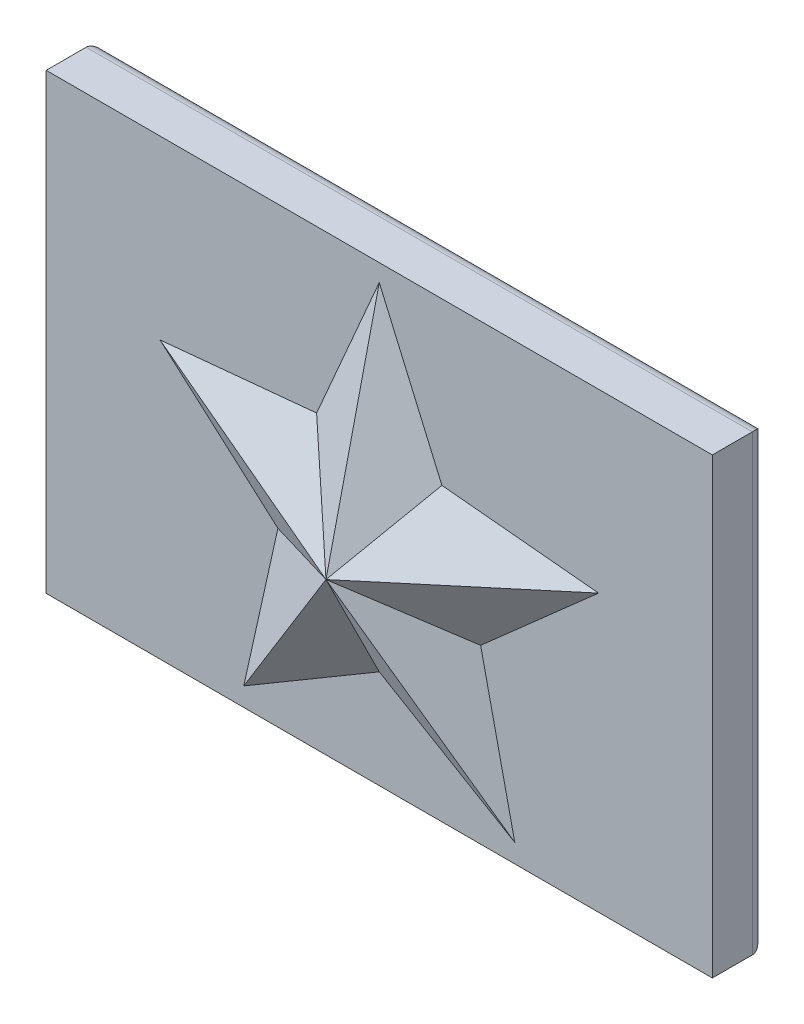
ISO-10303-21;
HEADER;
FILE_DESCRIPTION(('STEP AP214'),'2;1');
FILE_NAME('part.step','',(''),(''),'','','');
FILE_SCHEMA(('AUTOMOTIVE_DESIGN { 1 0 10303 214 1 1 1 1 }'));
ENDSEC;
DATA;
#1=APPLICATION_CONTEXT('core data for automotive mechanical design processes');
#2=APPLICATION_PROTOCOL_DEFINITION('international standard','automotive_design',2000,#1);
#3=PRODUCT_CONTEXT('',#1,'mechanical');
#4=PRODUCT('Part','Part','',(#3));
#5=PRODUCT_RELATED_PRODUCT_CATEGORY('part','',(#4));
#6=PRODUCT_DEFINITION_FORMATION('','',#4);
#7=PRODUCT_DEFINITION_CONTEXT('part definition',#1,'design');
#8=PRODUCT_DEFINITION('design','',#6,#7);
#9=PRODUCT_DEFINITION_SHAPE('','',#8);
#10=(LENGTH_UNIT() NAMED_UNIT(*) SI_UNIT(.MILLI.,.METRE.));
#11=(NAMED_UNIT(*) PLANE_ANGLE_UNIT() SI_UNIT($,.RADIAN.));
#12=(NAMED_UNIT(*) SI_UNIT($,.STERADIAN.) SOLID_ANGLE_UNIT());
#13=UNCERTAINTY_MEASURE_WITH_UNIT(LENGTH_MEASURE(1.E-05),#10,'distance_accuracy_value','');
#14=(GEOMETRIC_REPRESENTATION_CONTEXT(3) GLOBAL_UNCERTAINTY_ASSIGNED_CONTEXT((#13)) GLOBAL_UNIT_ASSIGNED_CONTEXT((#10,
#11,#12)) REPRESENTATION_CONTEXT('',''));
#15=CARTESIAN_POINT('',(0.,0.,0.));
#16=DIRECTION('',(0.,0.,1.));
#17=DIRECTION('',(1.,0.,0.));
#18=AXIS2_PLACEMENT_3D('',#15,#16,#17);
#19=CARTESIAN_POINT('',(0.,0.,2.54));
#20=DIRECTION('',(0.,0.,-1.));
#21=DIRECTION('',(-1.,0.,0.));
#22=AXIS2_PLACEMENT_3D('',#19,#20,#21);
#23=PLANE('',#22);
#24=DIRECTION('',(0.,1.,0.));
#25=VECTOR('',#24,1.);
#26=CARTESIAN_POINT('',(15.875,-10.795,2.54));
#27=LINE('',#26,#25);
#28=CARTESIAN_POINT('',(15.875,-10.795,2.54));
#29=VERTEX_POINT('',#28);
#30=CARTESIAN_POINT('',(15.875,10.795,2.54));
#31=VERTEX_POINT('',#30);
#32=EDGE_CURVE('E158',#29,#31,#27,.T.);
#33=ORIENTED_EDGE('',*,*,#32,.T.);
#34=DIRECTION('',(-1.,0.,0.));
#35=VECTOR('',#34,1.);
#36=CARTESIAN_POINT('',(-15.875,10.795,2.54));
#37=LINE('',#36,#35);
#38=CARTESIAN_POINT('',(-15.875,10.795,2.54));
#39=VERTEX_POINT('',#38);
#40=EDGE_CURVE('E161',#31,#39,#37,.T.);
#41=ORIENTED_EDGE('',*,*,#40,.T.);
#42=DIRECTION('',(0.,-1.,0.));
#43=VECTOR('',#42,1.);
#44=CARTESIAN_POINT('',(-15.875,-10.795,2.54));
#45=LINE('',#44,#43);
#46=CARTESIAN_POINT('',(-15.875,-10.795,2.54));
#47=VERTEX_POINT('',#46);
#48=EDGE_CURVE('E165',#39,#47,#45,.T.);
#49=ORIENTED_EDGE('',*,*,#48,.T.);
#50=DIRECTION('',(1.,0.,0.));
#51=VECTOR('',#50,1.);
#52=CARTESIAN_POINT('',(-15.875,-10.795,2.54));
#53=LINE('',#52,#51);
#54=EDGE_CURVE('E168',#47,#29,#53,.T.);
#55=ORIENTED_EDGE('',*,*,#54,.T.);
#56=EDGE_LOOP('',(#33,#41,#49,#55));
#57=FACE_BOUND('',#56,.T.);
#58=DIRECTION('',(-0.995455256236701,0.0952304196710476,0.));
#59=VECTOR('',#58,1.);
#60=CARTESIAN_POINT('',(2.98594908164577,3.09380633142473,2.54));
#61=LINE('',#60,#59);
#62=CARTESIAN_POINT('',(10.4508217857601,2.37967784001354,2.54));
#63=VERTEX_POINT('',#62);
#64=CARTESIAN_POINT('',(2.98594908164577,3.09380633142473,2.54));
#65=VERTEX_POINT('',#64);
#66=EDGE_CURVE('E135',#63,#65,#61,.T.);
#67=ORIENTED_EDGE('',*,*,#66,.F.);
#68=DIRECTION('',(0.749365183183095,0.662156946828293,0.));
#69=VECTOR('',#68,1.);
#70=CARTESIAN_POINT('',(10.4508217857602,2.37967784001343,2.54));
#71=LINE('',#70,#69);
#72=CARTESIAN_POINT('',(4.83136710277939,-2.58580633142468,2.54));
#73=VERTEX_POINT('',#72);
#74=EDGE_CURVE('E127',#73,#63,#71,.T.);
#75=ORIENTED_EDGE('',*,*,#74,.F.);
#76=DIRECTION('',(-0.217043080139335,0.976162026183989,0.));
#77=VECTOR('',#76,1.);
#78=CARTESIAN_POINT('',(4.83136710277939,-2.58580633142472,2.54));
#79=LINE('',#78,#77);
#80=CARTESIAN_POINT('',(6.45896307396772,-9.90599999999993,2.54));
#81=VERTEX_POINT('',#80);
#82=EDGE_CURVE('E136',#81,#73,#79,.T.);
#83=ORIENTED_EDGE('',*,*,#82,.F.);
#84=DIRECTION('',(0.861315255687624,-0.508070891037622,0.));
#85=VECTOR('',#84,1.);
#86=CARTESIAN_POINT('',(6.45896307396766,-9.906,2.54));
#87=LINE('',#86,#85);
#88=CARTESIAN_POINT('',(0.,-6.09599999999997,2.54));
#89=VERTEX_POINT('',#88);
#90=EDGE_CURVE('E261',#89,#81,#87,.T.);
#91=ORIENTED_EDGE('',*,*,#90,.F.);
#92=DIRECTION('',(0.861315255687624,0.508070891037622,0.));
#93=VECTOR('',#92,1.);
#94=CARTESIAN_POINT('',(0.,-6.096,2.54));
#95=LINE('',#94,#93);
#96=CARTESIAN_POINT('',(-6.45896307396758,-9.90600000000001,2.54));
#97=VERTEX_POINT('',#96);
#98=EDGE_CURVE('E258',#97,#89,#95,.T.);
#99=ORIENTED_EDGE('',*,*,#98,.F.);
#100=DIRECTION('',(-0.217043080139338,-0.976162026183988,0.));
#101=VECTOR('',#100,1.);
#102=CARTESIAN_POINT('',(-6.45896307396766,-9.906,2.54));
#103=LINE('',#102,#101);
#104=CARTESIAN_POINT('',(-4.83136710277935,-2.58580633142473,2.54));
#105=VERTEX_POINT('',#104);
#106=EDGE_CURVE('E254',#105,#97,#103,.T.);
#107=ORIENTED_EDGE('',*,*,#106,.F.);
#108=DIRECTION('',(0.749365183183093,-0.662156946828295,0.));
#109=VECTOR('',#108,1.);
#110=CARTESIAN_POINT('',(-4.83136710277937,-2.58580633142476,2.54));
#111=LINE('',#110,#109);
#112=CARTESIAN_POINT('',(-10.4508217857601,2.37967784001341,2.54));
#113=VERTEX_POINT('',#112);
#114=EDGE_CURVE('E248',#113,#105,#111,.T.);
#115=ORIENTED_EDGE('',*,*,#114,.F.);
#116=DIRECTION('',(-0.995455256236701,-0.0952304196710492,0.));
#117=VECTOR('',#116,1.);
#118=CARTESIAN_POINT('',(-10.4508217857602,2.37967784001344,2.54));
#119=LINE('',#118,#117);
#120=CARTESIAN_POINT('',(-2.98594908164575,3.09380633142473,2.54));
#121=VERTEX_POINT('',#120);
#122=EDGE_CURVE('E231',#121,#113,#119,.T.);
#123=ORIENTED_EDGE('',*,*,#122,.F.);
#124=DIRECTION('',(-0.398182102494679,-0.917306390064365,0.));
#125=VECTOR('',#124,1.);
#126=CARTESIAN_POINT('',(-2.98594908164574,3.09380633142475,2.54));
#127=LINE('',#126,#125);
#128=CARTESIAN_POINT('',(0.,9.97264431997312,2.54));
#129=VERTEX_POINT('',#128);
#130=EDGE_CURVE('E237',#129,#121,#127,.T.);
#131=ORIENTED_EDGE('',*,*,#130,.F.);
#132=DIRECTION('',(-0.398182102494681,0.917306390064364,0.));
#133=VECTOR('',#132,1.);
#134=CARTESIAN_POINT('',(0.,9.97264431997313,2.54));
#135=LINE('',#134,#133);
#136=EDGE_CURVE('E149',#65,#129,#135,.T.);
#137=ORIENTED_EDGE('',*,*,#136,.F.);
#138=EDGE_LOOP('',(#67,#75,#83,#91,#99,#107,#115,#123,#131,#137));
#139=FACE_BOUND('',#138,.T.);
#140=ADVANCED_FACE('F39',(#57,#139),#23,.F.);
#141=CARTESIAN_POINT('',(15.875,-10.795,2.54));
#142=DIRECTION('',(-1.,0.,0.));
#143=DIRECTION('',(0.,0.,1.));
#144=AXIS2_PLACEMENT_3D('',#141,#142,#143);
#145=PLANE('',#144);
#146=DIRECTION('',(0.,0.,-1.));
#147=VECTOR('',#146,1.);
#148=CARTESIAN_POINT('',(15.875,-10.795,2.54));
#149=LINE('',#148,#147);
#150=CARTESIAN_POINT('',(15.875,-10.795,0.635));
#151=VERTEX_POINT('',#150);
#152=EDGE_CURVE('E171',#29,#151,#149,.T.);
#153=ORIENTED_EDGE('',*,*,#152,.T.);
#154=DIRECTION('',(0.,1.,0.));
#155=VECTOR('',#154,1.);
#156=CARTESIAN_POINT('',(15.875,10.795,0.635));
#157=LINE('',#156,#155);
#158=CARTESIAN_POINT('',(15.875,10.795,0.635));
#159=VERTEX_POINT('',#158);
#160=EDGE_CURVE('E63',#151,#159,#157,.T.);
#161=ORIENTED_EDGE('',*,*,#160,.T.);
#162=DIRECTION('',(0.,0.,-1.));
#163=VECTOR('',#162,1.);
#164=CARTESIAN_POINT('',(15.875,10.795,2.54));
#165=LINE('',#164,#163);
#166=EDGE_CURVE('E182',#31,#159,#165,.T.);
#167=ORIENTED_EDGE('',*,*,#166,.F.);
#168=ORIENTED_EDGE('',*,*,#32,.F.);
#169=EDGE_LOOP('',(#153,#161,#167,#168));
#170=FACE_BOUND('',#169,.T.);
#171=ADVANCED_FACE('F299',(#170),#145,.F.);
#172=CARTESIAN_POINT('',(-15.875,10.795,2.54));
#173=DIRECTION('',(0.,-1.,0.));
#174=DIRECTION('',(0.,0.,-1.));
#175=AXIS2_PLACEMENT_3D('',#172,#173,#174);
#176=PLANE('',#175);
#177=ORIENTED_EDGE('',*,*,#166,.T.);
#178=DIRECTION('',(-1.,0.,0.));
#179=VECTOR('',#178,1.);
#180=CARTESIAN_POINT('',(-15.875,10.795,0.635));
#181=LINE('',#180,#179);
#182=CARTESIAN_POINT('',(-15.875,10.795,0.635));
#183=VERTEX_POINT('',#182);
#184=EDGE_CURVE('E205',#159,#183,#181,.T.);
#185=ORIENTED_EDGE('',*,*,#184,.T.);
#186=DIRECTION('',(0.,0.,-1.));
#187=VECTOR('',#186,1.);
#188=CARTESIAN_POINT('',(-15.875,10.795,2.54));
#189=LINE('',#188,#187);
#190=EDGE_CURVE('E178',#39,#183,#189,.T.);
#191=ORIENTED_EDGE('',*,*,#190,.F.);
#192=ORIENTED_EDGE('',*,*,#40,.F.);
#193=EDGE_LOOP('',(#177,#185,#191,#192));
#194=FACE_BOUND('',#193,.T.);
#195=ADVANCED_FACE('F306',(#194),#176,.F.);
#196=CARTESIAN_POINT('',(-15.875,-10.795,2.54));
#197=DIRECTION('',(1.,0.,0.));
#198=DIRECTION('',(0.,0.,-1.));
#199=AXIS2_PLACEMENT_3D('',#196,#197,#198);
#200=PLANE('',#199);
#201=ORIENTED_EDGE('',*,*,#190,.T.);
#202=DIRECTION('',(0.,-1.,0.));
#203=VECTOR('',#202,1.);
#204=CARTESIAN_POINT('',(-15.875,-10.795,0.635));
#205=LINE('',#204,#203);
#206=CARTESIAN_POINT('',(-15.875,-10.795,0.635));
#207=VERTEX_POINT('',#206);
#208=EDGE_CURVE('E185',#183,#207,#205,.T.);
#209=ORIENTED_EDGE('',*,*,#208,.T.);
#210=DIRECTION('',(0.,0.,-1.));
#211=VECTOR('',#210,1.);
#212=CARTESIAN_POINT('',(-15.875,-10.795,2.54));
#213=LINE('',#212,#211);
#214=EDGE_CURVE('E174',#47,#207,#213,.T.);
#215=ORIENTED_EDGE('',*,*,#214,.F.);
#216=ORIENTED_EDGE('',*,*,#48,.F.);
#217=EDGE_LOOP('',(#201,#209,#215,#216));
#218=FACE_BOUND('',#217,.T.);
#219=ADVANCED_FACE('F318',(#218),#200,.F.);
#220=CARTESIAN_POINT('',(-15.875,-10.795,2.54));
#221=DIRECTION('',(0.,1.,0.));
#222=DIRECTION('',(0.,0.,1.));
#223=AXIS2_PLACEMENT_3D('',#220,#221,#222);
#224=PLANE('',#223);
#225=ORIENTED_EDGE('',*,*,#214,.T.);
#226=DIRECTION('',(1.,0.,0.));
#227=VECTOR('',#226,1.);
#228=CARTESIAN_POINT('',(15.875,-10.795,0.635));
#229=LINE('',#228,#227);
#230=EDGE_CURVE('E202',#207,#151,#229,.T.);
#231=ORIENTED_EDGE('',*,*,#230,.T.);
#232=ORIENTED_EDGE('',*,*,#152,.F.);
#233=ORIENTED_EDGE('',*,*,#54,.F.);
#234=EDGE_LOOP('',(#225,#231,#232,#233));
#235=FACE_BOUND('',#234,.T.);
#236=ADVANCED_FACE('F314',(#235),#224,.F.);
#237=CARTESIAN_POINT('',(0.,0.,0.));
#238=DIRECTION('',(0.,0.,-1.));
#239=DIRECTION('',(-1.,0.,0.));
#240=AXIS2_PLACEMENT_3D('',#237,#238,#239);
#241=PLANE('',#240);
#242=DIRECTION('',(1.,0.,0.));
#243=VECTOR('',#242,1.);
#244=CARTESIAN_POINT('',(-15.875,-10.16,0.));
#245=LINE('',#244,#243);
#246=CARTESIAN_POINT('',(15.24,-10.16,0.));
#247=VERTEX_POINT('',#246);
#248=CARTESIAN_POINT('',(-15.24,-10.16,0.));
#249=VERTEX_POINT('',#248);
#250=EDGE_CURVE('E195',#247,#249,#245,.F.);
#251=ORIENTED_EDGE('',*,*,#250,.T.);
#252=DIRECTION('',(0.,-1.,0.));
#253=VECTOR('',#252,1.);
#254=CARTESIAN_POINT('',(-15.24,10.795,0.));
#255=LINE('',#254,#253);
#256=CARTESIAN_POINT('',(-15.24,10.16,0.));
#257=VERTEX_POINT('',#256);
#258=EDGE_CURVE('E198',#249,#257,#255,.F.);
#259=ORIENTED_EDGE('',*,*,#258,.T.);
#260=DIRECTION('',(-1.,0.,0.));
#261=VECTOR('',#260,1.);
#262=CARTESIAN_POINT('',(15.875,10.16,0.));
#263=LINE('',#262,#261);
#264=CARTESIAN_POINT('',(15.24,10.16,0.));
#265=VERTEX_POINT('',#264);
#266=EDGE_CURVE('E192',#257,#265,#263,.F.);
#267=ORIENTED_EDGE('',*,*,#266,.T.);
#268=DIRECTION('',(0.,1.,0.));
#269=VECTOR('',#268,1.);
#270=CARTESIAN_POINT('',(15.24,-10.795,0.));
#271=LINE('',#270,#269);
#272=EDGE_CURVE('E189',#265,#247,#271,.F.);
#273=ORIENTED_EDGE('',*,*,#272,.T.);
#274=EDGE_LOOP('',(#251,#259,#267,#273));
#275=FACE_BOUND('',#274,.T.);
#276=ADVANCED_FACE('F311',(#275),#241,.T.);
#277=CARTESIAN_POINT('',(15.24,-10.795,0.635));
#278=DIRECTION('',(0.,-1.,0.));
#279=DIRECTION('',(0.,0.,-1.));
#280=AXIS2_PLACEMENT_3D('',#277,#278,#279);
#281=CYLINDRICAL_SURFACE('',#280,0.635);
#282=CARTESIAN_POINT('',(15.24,-10.16,0.635));
#283=DIRECTION('',(-0.707106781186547,-0.707106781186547,0.));
#284=DIRECTION('',(0.707106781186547,-0.707106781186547,0.));
#285=AXIS2_PLACEMENT_3D('',#282,#283,#284);
#286=ELLIPSE('',#285,0.898025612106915,0.635);
#287=EDGE_CURVE('E213',#247,#151,#286,.T.);
#288=ORIENTED_EDGE('',*,*,#287,.F.);
#289=ORIENTED_EDGE('',*,*,#272,.F.);
#290=CARTESIAN_POINT('',(15.24,10.16,0.635));
#291=DIRECTION('',(0.707106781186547,-0.707106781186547,0.));
#292=DIRECTION('',(-0.707106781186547,-0.707106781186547,0.));
#293=AXIS2_PLACEMENT_3D('',#290,#291,#292);
#294=ELLIPSE('',#293,0.898025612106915,0.635);
#295=EDGE_CURVE('E162',#159,#265,#294,.F.);
#296=ORIENTED_EDGE('',*,*,#295,.F.);
#297=ORIENTED_EDGE('',*,*,#160,.F.);
#298=EDGE_LOOP('',(#288,#289,#296,#297));
#299=FACE_BOUND('',#298,.T.);
#300=ADVANCED_FACE('F41',(#299),#281,.T.);
#301=CARTESIAN_POINT('',(-15.875,10.16,0.635));
#302=DIRECTION('',(1.,0.,0.));
#303=DIRECTION('',(0.,0.,-1.));
#304=AXIS2_PLACEMENT_3D('',#301,#302,#303);
#305=CYLINDRICAL_SURFACE('',#304,0.635);
#306=ORIENTED_EDGE('',*,*,#295,.T.);
#307=ORIENTED_EDGE('',*,*,#266,.F.);
#308=CARTESIAN_POINT('',(-15.24,10.16,0.635));
#309=DIRECTION('',(0.707106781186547,0.707106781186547,0.));
#310=DIRECTION('',(0.707106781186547,-0.707106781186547,0.));
#311=AXIS2_PLACEMENT_3D('',#308,#309,#310);
#312=ELLIPSE('',#311,0.898025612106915,0.635);
#313=EDGE_CURVE('E154',#183,#257,#312,.F.);
#314=ORIENTED_EDGE('',*,*,#313,.F.);
#315=ORIENTED_EDGE('',*,*,#184,.F.);
#316=EDGE_LOOP('',(#306,#307,#314,#315));
#317=FACE_BOUND('',#316,.T.);
#318=ADVANCED_FACE('F332',(#317),#305,.T.);
#319=CARTESIAN_POINT('',(-15.875,-10.16,0.635));
#320=DIRECTION('',(-1.,0.,0.));
#321=DIRECTION('',(0.,0.,1.));
#322=AXIS2_PLACEMENT_3D('',#319,#320,#321);
#323=CYLINDRICAL_SURFACE('',#322,0.635);
#324=ORIENTED_EDGE('',*,*,#287,.T.);
#325=ORIENTED_EDGE('',*,*,#230,.F.);
#326=CARTESIAN_POINT('',(-15.24,-10.16,0.635));
#327=DIRECTION('',(-0.707106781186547,0.707106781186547,0.));
#328=DIRECTION('',(-0.707106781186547,-0.707106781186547,0.));
#329=AXIS2_PLACEMENT_3D('',#326,#327,#328);
#330=ELLIPSE('',#329,0.898025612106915,0.635);
#331=EDGE_CURVE('E151',#249,#207,#330,.T.);
#332=ORIENTED_EDGE('',*,*,#331,.F.);
#333=ORIENTED_EDGE('',*,*,#250,.F.);
#334=EDGE_LOOP('',(#324,#325,#332,#333));
#335=FACE_BOUND('',#334,.T.);
#336=ADVANCED_FACE('F329',(#335),#323,.T.);
#337=CARTESIAN_POINT('',(-15.24,-10.795,0.635));
#338=DIRECTION('',(0.,1.,0.));
#339=DIRECTION('',(0.,0.,1.));
#340=AXIS2_PLACEMENT_3D('',#337,#338,#339);
#341=CYLINDRICAL_SURFACE('',#340,0.635);
#342=ORIENTED_EDGE('',*,*,#313,.T.);
#343=ORIENTED_EDGE('',*,*,#258,.F.);
#344=ORIENTED_EDGE('',*,*,#331,.T.);
#345=ORIENTED_EDGE('',*,*,#208,.F.);
#346=EDGE_LOOP('',(#342,#343,#344,#345));
#347=FACE_BOUND('',#346,.T.);
#348=ADVANCED_FACE('F326',(#347),#341,.T.);
#349=CARTESIAN_POINT('',(0.,9.97264431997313,2.54));
#350=DIRECTION('',(-0.460530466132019,-0.199905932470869,-0.864840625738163));
#351=DIRECTION('',(-0.882656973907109,0.,0.470017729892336));
#352=AXIS2_PLACEMENT_3D('',#349,#350,#351);
#353=PLANE('',#352);
#354=ORIENTED_EDGE('',*,*,#136,.T.);
#355=DIRECTION('',(0.,-0.974310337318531,0.225209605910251));
#356=VECTOR('',#355,1.);
#357=CARTESIAN_POINT('',(0.,9.97264431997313,2.54));
#358=LINE('',#357,#356);
#359=CARTESIAN_POINT('',(0.,-1.01599999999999,5.08));
#360=VERTEX_POINT('',#359);
#361=EDGE_CURVE('E209',#129,#360,#358,.T.);
#362=ORIENTED_EDGE('',*,*,#361,.T.);
#363=DIRECTION('',(-0.525731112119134,-0.723606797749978,0.447213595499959));
#364=VECTOR('',#363,1.);
#365=CARTESIAN_POINT('',(2.98594908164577,3.09380633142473,2.54));
#366=LINE('',#365,#364);
#367=EDGE_CURVE('E142',#65,#360,#366,.T.);
#368=ORIENTED_EDGE('',*,*,#367,.F.);
#369=EDGE_LOOP('',(#354,#362,#368));
#370=FACE_BOUND('',#369,.T.);
#371=ADVANCED_FACE('F242',(#370),#353,.F.);
#372=CARTESIAN_POINT('',(2.98594908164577,3.09380633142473,2.54));
#373=DIRECTION('',(-0.0478100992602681,-0.499764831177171,-0.864840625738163));
#374=DIRECTION('',(0.,0.865830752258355,-0.500336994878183));
#375=AXIS2_PLACEMENT_3D('',#372,#373,#374);
#376=PLANE('',#375);
#377=ORIENTED_EDGE('',*,*,#367,.T.);
#378=DIRECTION('',(0.926624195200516,0.301078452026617,-0.225209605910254));
#379=VECTOR('',#378,1.);
#380=CARTESIAN_POINT('',(4.24047249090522,0.361813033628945,4.04938247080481));
#381=LINE('',#380,#379);
#382=EDGE_CURVE('E130',#360,#63,#381,.T.);
#383=ORIENTED_EDGE('',*,*,#382,.T.);
#384=ORIENTED_EDGE('',*,*,#66,.T.);
#385=EDGE_LOOP('',(#377,#383,#384));
#386=FACE_BOUND('',#385,.T.);
#387=ADVANCED_FACE('F140',(#386),#376,.F.);
#388=CARTESIAN_POINT('',(-2.98594908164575,3.09380633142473,2.54));
#389=DIRECTION('',(0.46053046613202,-0.199905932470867,-0.864840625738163));
#390=DIRECTION('',(-0.882656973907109,0.,-0.470017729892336));
#391=AXIS2_PLACEMENT_3D('',#388,#389,#390);
#392=PLANE('',#391);
#393=ORIENTED_EDGE('',*,*,#130,.T.);
#394=DIRECTION('',(0.525731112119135,-0.723606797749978,0.447213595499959));
#395=VECTOR('',#394,1.);
#396=CARTESIAN_POINT('',(-2.98594908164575,3.09380633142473,2.54));
#397=LINE('',#396,#395);
#398=EDGE_CURVE('E229',#121,#360,#397,.T.);
#399=ORIENTED_EDGE('',*,*,#398,.T.);
#400=ORIENTED_EDGE('',*,*,#361,.F.);
#401=EDGE_LOOP('',(#393,#399,#400));
#402=FACE_BOUND('',#401,.T.);
#403=ADVANCED_FACE('F236',(#402),#392,.F.);
#404=CARTESIAN_POINT('',(-10.4508217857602,2.37967784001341,2.54));
#405=DIRECTION('',(0.0478100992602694,-0.49976483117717,-0.864840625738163));
#406=DIRECTION('',(0.,0.865830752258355,-0.500336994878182));
#407=AXIS2_PLACEMENT_3D('',#404,#405,#406);
#408=PLANE('',#407);
#409=ORIENTED_EDGE('',*,*,#122,.T.);
#410=DIRECTION('',(0.926624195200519,-0.301078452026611,0.225209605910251));
#411=VECTOR('',#410,1.);
#412=CARTESIAN_POINT('',(-10.4508217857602,2.37967784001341,2.54));
#413=LINE('',#412,#411);
#414=EDGE_CURVE('E48',#113,#360,#413,.T.);
#415=ORIENTED_EDGE('',*,*,#414,.T.);
#416=ORIENTED_EDGE('',*,*,#398,.F.);
#417=EDGE_LOOP('',(#409,#415,#416));
#418=FACE_BOUND('',#417,.T.);
#419=ADVANCED_FACE('F228',(#418),#408,.F.);
#420=CARTESIAN_POINT('',(-6.45896307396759,-9.90600000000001,2.54));
#421=DIRECTION('',(0.490078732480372,-0.108965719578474,-0.864840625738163));
#422=DIRECTION('',(-0.870021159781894,0.,-0.493014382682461));
#423=AXIS2_PLACEMENT_3D('',#420,#421,#422);
#424=PLANE('',#423);
#425=ORIENTED_EDGE('',*,*,#106,.T.);
#426=DIRECTION('',(0.572685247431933,0.788233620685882,0.225209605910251));
#427=VECTOR('',#426,1.);
#428=CARTESIAN_POINT('',(-6.45896307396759,-9.90600000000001,2.54));
#429=LINE('',#428,#427);
#430=EDGE_CURVE('E276',#97,#360,#429,.T.);
#431=ORIENTED_EDGE('',*,*,#430,.T.);
#432=DIRECTION('',(0.850650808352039,0.276393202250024,0.447213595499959));
#433=VECTOR('',#432,1.);
#434=CARTESIAN_POINT('',(-4.83136710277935,-2.58580633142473,2.54));
#435=LINE('',#434,#433);
#436=EDGE_CURVE('E239',#105,#360,#435,.T.);
#437=ORIENTED_EDGE('',*,*,#436,.F.);
#438=EDGE_LOOP('',(#425,#431,#437));
#439=FACE_BOUND('',#438,.T.);
#440=ADVANCED_FACE('F287',(#439),#424,.F.);
#441=CARTESIAN_POINT('',(-4.83136710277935,-2.58580633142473,2.54));
#442=DIRECTION('',(0.332433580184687,0.376216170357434,-0.864840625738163));
#443=DIRECTION('',(0.,0.916993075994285,0.398903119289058));
#444=AXIS2_PLACEMENT_3D('',#441,#442,#443);
#445=PLANE('',#444);
#446=ORIENTED_EDGE('',*,*,#114,.T.);
#447=ORIENTED_EDGE('',*,*,#436,.T.);
#448=ORIENTED_EDGE('',*,*,#414,.F.);
#449=EDGE_LOOP('',(#446,#447,#448));
#450=FACE_BOUND('',#449,.T.);
#451=ADVANCED_FACE('F285',(#450),#445,.F.);
#452=CARTESIAN_POINT('',(6.45896307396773,-9.90599999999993,2.54));
#453=DIRECTION('',(0.255075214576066,0.432420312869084,-0.864840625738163));
#454=DIRECTION('',(0.,0.894427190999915,0.44721359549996));
#455=AXIS2_PLACEMENT_3D('',#452,#453,#454);
#456=PLANE('',#455);
#457=ORIENTED_EDGE('',*,*,#90,.T.);
#458=DIRECTION('',(-0.572685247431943,0.788233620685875,0.225209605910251));
#459=VECTOR('',#458,1.);
#460=CARTESIAN_POINT('',(6.45896307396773,-9.90599999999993,2.54));
#461=LINE('',#460,#459);
#462=EDGE_CURVE('E11',#81,#360,#461,.T.);
#463=ORIENTED_EDGE('',*,*,#462,.T.);
#464=DIRECTION('',(0.,0.894427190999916,0.447213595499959));
#465=VECTOR('',#464,1.);
#466=CARTESIAN_POINT('',(0.,-6.09599999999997,2.54));
#467=LINE('',#466,#465);
#468=EDGE_CURVE('E144',#89,#360,#467,.T.);
#469=ORIENTED_EDGE('',*,*,#468,.F.);
#470=EDGE_LOOP('',(#457,#463,#469));
#471=FACE_BOUND('',#470,.T.);
#472=ADVANCED_FACE('F271',(#471),#456,.F.);
#473=CARTESIAN_POINT('',(0.,-6.09599999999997,2.54));
#474=DIRECTION('',(-0.255075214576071,0.432420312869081,-0.864840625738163));
#475=DIRECTION('',(0.,0.894427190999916,0.447213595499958));
#476=AXIS2_PLACEMENT_3D('',#473,#474,#475);
#477=PLANE('',#476);
#478=ORIENTED_EDGE('',*,*,#98,.T.);
#479=ORIENTED_EDGE('',*,*,#468,.T.);
#480=ORIENTED_EDGE('',*,*,#430,.F.);
#481=EDGE_LOOP('',(#478,#479,#480));
#482=FACE_BOUND('',#481,.T.);
#483=ADVANCED_FACE('F288',(#482),#477,.F.);
#484=CARTESIAN_POINT('',(10.4508217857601,2.37967784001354,2.54));
#485=DIRECTION('',(-0.332433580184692,0.37621617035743,-0.864840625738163));
#486=DIRECTION('',(0.,0.916993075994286,0.398903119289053));
#487=AXIS2_PLACEMENT_3D('',#484,#485,#486);
#488=PLANE('',#487);
#489=DIRECTION('',(-0.850650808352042,0.276393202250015,0.447213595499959));
#490=VECTOR('',#489,1.);
#491=CARTESIAN_POINT('',(4.83136710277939,-2.58580633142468,2.54));
#492=LINE('',#491,#490);
#493=EDGE_CURVE('E55',#73,#360,#492,.T.);
#494=ORIENTED_EDGE('',*,*,#493,.F.);
#495=ORIENTED_EDGE('',*,*,#74,.T.);
#496=ORIENTED_EDGE('',*,*,#382,.F.);
#497=EDGE_LOOP('',(#494,#495,#496));
#498=FACE_BOUND('',#497,.T.);
#499=ADVANCED_FACE('F129',(#498),#488,.F.);
#500=CARTESIAN_POINT('',(4.83136710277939,-2.58580633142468,2.54));
#501=DIRECTION('',(-0.490078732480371,-0.10896571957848,-0.864840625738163));
#502=DIRECTION('',(-0.870021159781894,0.,0.49301438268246));
#503=AXIS2_PLACEMENT_3D('',#500,#501,#502);
#504=PLANE('',#503);
#505=ORIENTED_EDGE('',*,*,#82,.T.);
#506=ORIENTED_EDGE('',*,*,#493,.T.);
#507=ORIENTED_EDGE('',*,*,#462,.F.);
#508=EDGE_LOOP('',(#505,#506,#507));
#509=FACE_BOUND('',#508,.T.);
#510=ADVANCED_FACE('F265',(#509),#504,.F.);
#511=CLOSED_SHELL('',(#140,#171,#195,#219,#236,#276,#300,#318,#336,#348,#371,#387,#403,#419,
#440,#451,#472,#483,#499,#510));
#512=MANIFOLD_SOLID_BREP('B2',#511);
#513=ADVANCED_BREP_SHAPE_REPRESENTATION('',(#18,#512),#14);
#514=SHAPE_DEFINITION_REPRESENTATION(#9,#513);
ENDSEC;
END-ISO-10303-21;
